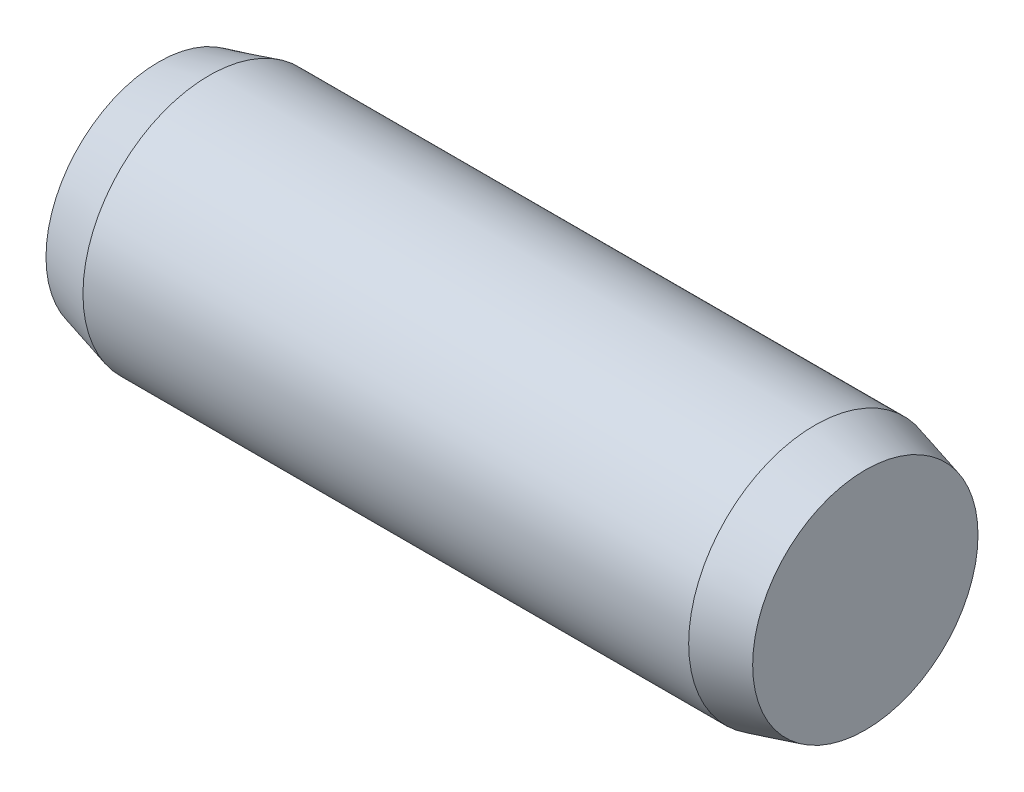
ISO-10303-21;
HEADER;
FILE_DESCRIPTION(('STEP AP214'),'2;1');
FILE_NAME('part.step','',(''),(''),'','','');
FILE_SCHEMA(('AUTOMOTIVE_DESIGN { 1 0 10303 214 1 1 1 1 }'));
ENDSEC;
DATA;
#1=APPLICATION_CONTEXT('core data for automotive mechanical design processes');
#2=APPLICATION_PROTOCOL_DEFINITION('international standard','automotive_design',2000,#1);
#3=PRODUCT_CONTEXT('',#1,'mechanical');
#4=PRODUCT('Part','Part','',(#3));
#5=PRODUCT_RELATED_PRODUCT_CATEGORY('part','',(#4));
#6=PRODUCT_DEFINITION_FORMATION('','',#4);
#7=PRODUCT_DEFINITION_CONTEXT('part definition',#1,'design');
#8=PRODUCT_DEFINITION('design','',#6,#7);
#9=PRODUCT_DEFINITION_SHAPE('','',#8);
#10=(LENGTH_UNIT() NAMED_UNIT(*) SI_UNIT(.MILLI.,.METRE.));
#11=(NAMED_UNIT(*) PLANE_ANGLE_UNIT() SI_UNIT($,.RADIAN.));
#12=(NAMED_UNIT(*) SI_UNIT($,.STERADIAN.) SOLID_ANGLE_UNIT());
#13=UNCERTAINTY_MEASURE_WITH_UNIT(LENGTH_MEASURE(1.E-05),#10,'distance_accuracy_value','');
#14=(GEOMETRIC_REPRESENTATION_CONTEXT(3) GLOBAL_UNCERTAINTY_ASSIGNED_CONTEXT((#13)) GLOBAL_UNIT_ASSIGNED_CONTEXT((#10,
#11,#12)) REPRESENTATION_CONTEXT('',''));
#15=CARTESIAN_POINT('',(0.,0.,0.));
#16=DIRECTION('',(0.,0.,1.));
#17=DIRECTION('',(1.,0.,0.));
#18=AXIS2_PLACEMENT_3D('',#15,#16,#17);
#19=CARTESIAN_POINT('',(0.,4.46410161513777,0.));
#20=DIRECTION('',(1.,0.,0.));
#21=DIRECTION('',(0.,0.,-1.));
#22=AXIS2_PLACEMENT_3D('',#19,#20,#21);
#23=PLANE('',#22);
#24=CARTESIAN_POINT('',(0.,0.,0.));
#25=DIRECTION('',(-1.,0.,0.));
#26=DIRECTION('',(0.,0.,1.));
#27=AXIS2_PLACEMENT_3D('',#24,#25,#26);
#28=CIRCLE('',#27,4.46410161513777);
#29=CARTESIAN_POINT('',(0.,0.,4.46410161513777));
#30=VERTEX_POINT('',#29);
#31=EDGE_CURVE('E44',#30,#30,#28,.T.);
#32=ORIENTED_EDGE('',*,*,#31,.T.);
#33=EDGE_LOOP('',(#32));
#34=FACE_BOUND('',#33,.T.);
#35=ADVANCED_FACE('F30',(#34),#23,.F.);
#36=CARTESIAN_POINT('',(28.,0.,0.));
#37=DIRECTION('',(-1.,0.,0.));
#38=DIRECTION('',(0.,0.,1.));
#39=AXIS2_PLACEMENT_3D('',#36,#37,#38);
#40=PLANE('',#39);
#41=CARTESIAN_POINT('',(28.,0.,0.));
#42=DIRECTION('',(-1.,0.,0.));
#43=DIRECTION('',(0.,0.,1.));
#44=AXIS2_PLACEMENT_3D('',#41,#42,#43);
#45=CIRCLE('',#44,4.46410161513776);
#46=CARTESIAN_POINT('',(28.,0.,4.46410161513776));
#47=VERTEX_POINT('',#46);
#48=EDGE_CURVE('E10',#47,#47,#45,.T.);
#49=ORIENTED_EDGE('',*,*,#48,.F.);
#50=EDGE_LOOP('',(#49));
#51=FACE_BOUND('',#50,.T.);
#52=ADVANCED_FACE('F64',(#51),#40,.F.);
#53=CARTESIAN_POINT('',(28.,0.,0.));
#54=DIRECTION('',(-1.,0.,0.));
#55=DIRECTION('',(0.,0.,1.));
#56=AXIS2_PLACEMENT_3D('',#53,#54,#55);
#57=CONICAL_SURFACE('',#56,4.46410161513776,0.261799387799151);
#58=CARTESIAN_POINT('',(26.,0.,0.));
#59=DIRECTION('',(-1.,0.,0.));
#60=DIRECTION('',(0.,0.,1.));
#61=AXIS2_PLACEMENT_3D('',#58,#59,#60);
#62=CIRCLE('',#61,5.00000000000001);
#63=CARTESIAN_POINT('',(26.,0.,5.00000000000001));
#64=VERTEX_POINT('',#63);
#65=EDGE_CURVE('E36',#64,#64,#62,.T.);
#66=ORIENTED_EDGE('',*,*,#65,.F.);
#67=EDGE_LOOP('',(#66));
#68=FACE_BOUND('',#67,.T.);
#69=ORIENTED_EDGE('',*,*,#48,.T.);
#70=EDGE_LOOP('',(#69));
#71=FACE_BOUND('',#70,.T.);
#72=ADVANCED_FACE('F59',(#68,#71),#57,.T.);
#73=CARTESIAN_POINT('',(-6.35,0.,0.));
#74=DIRECTION('',(-1.,0.,0.));
#75=DIRECTION('',(0.,0.,1.));
#76=AXIS2_PLACEMENT_3D('',#73,#74,#75);
#77=CYLINDRICAL_SURFACE('',#76,5.);
#78=CARTESIAN_POINT('',(2.,0.,0.));
#79=DIRECTION('',(-1.,0.,0.));
#80=DIRECTION('',(0.,0.,1.));
#81=AXIS2_PLACEMENT_3D('',#78,#79,#80);
#82=CIRCLE('',#81,5.);
#83=CARTESIAN_POINT('',(2.,0.,5.));
#84=VERTEX_POINT('',#83);
#85=EDGE_CURVE('E40',#84,#84,#82,.T.);
#86=ORIENTED_EDGE('',*,*,#85,.F.);
#87=EDGE_LOOP('',(#86));
#88=FACE_BOUND('',#87,.T.);
#89=ORIENTED_EDGE('',*,*,#65,.T.);
#90=EDGE_LOOP('',(#89));
#91=FACE_BOUND('',#90,.T.);
#92=ADVANCED_FACE('F54',(#88,#91),#77,.T.);
#93=CARTESIAN_POINT('',(2.,0.,0.));
#94=DIRECTION('',(1.,0.,0.));
#95=DIRECTION('',(0.,0.,-1.));
#96=AXIS2_PLACEMENT_3D('',#93,#94,#95);
#97=CONICAL_SURFACE('',#96,5.,0.261799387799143);
#98=ORIENTED_EDGE('',*,*,#31,.F.);
#99=EDGE_LOOP('',(#98));
#100=FACE_BOUND('',#99,.T.);
#101=ORIENTED_EDGE('',*,*,#85,.T.);
#102=EDGE_LOOP('',(#101));
#103=FACE_BOUND('',#102,.T.);
#104=ADVANCED_FACE('F51',(#100,#103),#97,.T.);
#105=CLOSED_SHELL('',(#35,#52,#72,#92,#104));
#106=MANIFOLD_SOLID_BREP('B2',#105);
#107=ADVANCED_BREP_SHAPE_REPRESENTATION('',(#18,#106),#14);
#108=SHAPE_DEFINITION_REPRESENTATION(#9,#107);
ENDSEC;
END-ISO-10303-21;
